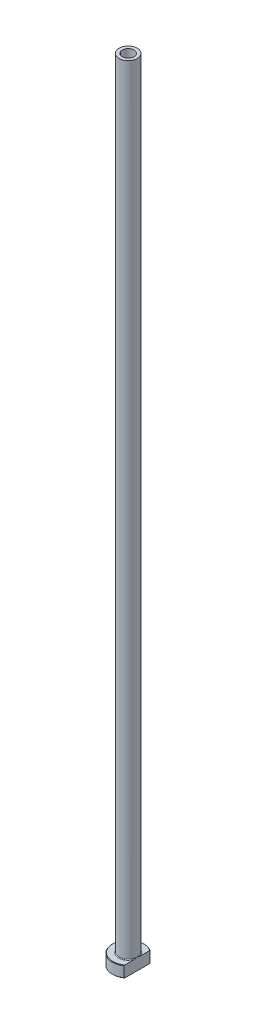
from build123d import *

# Parameters (mm, degrees)
FILLET1_R          = 0.3
CHAMFER1_SIZE      = 0.2
CUT_EXTRUDE1_DEPTH = 351.139972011
CHAMFER2_SIZE      = 0.5


with BuildPart() as part:
    # Sketch1 → Revolve1 (revolve)
    with BuildSketch(Plane.XY, mode=Mode.PRIVATE) as revolve1_sk:
        Polygon((-2.6, 350), (-4, 350), (-4, 5), (-7, 5), (-7, 0), (-2.85, 0), (-2.85, 293), (-2.6, 305), align=None)
    revolve(revolve1_sk.sketch.rotate(Axis((0, 92.187680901, 0), (0, -1, 0)), 270), axis=Axis((0, 92.187680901, 0), (0, -1, 0)))

    # Fillet1
    fillet1_edges = [part.edges().sort_by_distance(p)[0] for p in [
        (0, 5, -4),
    ]]
    fillet(fillet1_edges, radius=FILLET1_R)

    # Chamfer1
    chamfer1_edges = [part.edges().sort_by_distance(p)[0] for p in [
        (0, 0, -7),
        (0, 5, -7),
    ]]
    chamfer(chamfer1_edges, length=CHAMFER1_SIZE)

    # Sketch2 → Cut-Extrude1 (cut, through all)
    with BuildSketch(Plane.XZ):
        with BuildLine():
            Line((4, 5.744562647), (4, -5.744562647))
            ThreePointArc((4, -5.744562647), (7, 0), (4, 5.744562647))
        make_face()
    extrude(amount=-CUT_EXTRUDE1_DEPTH, mode=Mode.SUBTRACT)

    # Chamfer2
    chamfer2_edges = [part.edges().sort_by_distance(p)[0] for p in [
        (0, 0, -2.85),
    ]]
    chamfer(chamfer2_edges, length=CHAMFER2_SIZE)


solid = part.part
